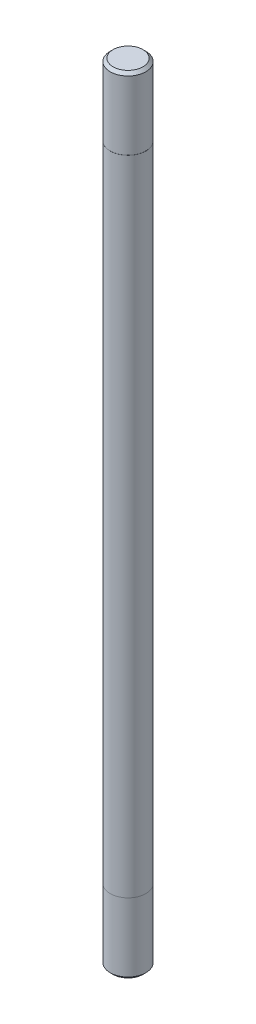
from build123d import *

# Parameters (mm, degrees)
SKETCH1_R      = 2.5
EXTRUDE1_DEPTH = 90
SKETCH2_R      = 2.49
EXTRUDE2_DEPTH = 10
EXTRUDE3_START = 10
SKETCH3_R      = 2.49
EXTRUDE3_DEPTH = 10
CHAMFER2_SIZE  = 0.4


with BuildPart() as part:
    # Sketch1 → Extrude1 (new body)
    with BuildSketch(Plane(origin=(0, 0, 0), x_dir=(1, 0, 0), z_dir=(0, 1, 0))):
        with Locations(Location((0, 0, 0), (0, 0, 90))):
            Circle(SKETCH1_R)
    extrude(amount=EXTRUDE1_DEPTH)

    # Sketch2 → Extrude2 (add)
    with BuildSketch(Plane(origin=(0, 90, 0), x_dir=(-1, 0, 0), z_dir=(0, 1, 0))):
        with Locations(Location((0, 0, 0), (0, 0, 90))):
            Circle(SKETCH2_R)
    extrude(amount=EXTRUDE2_DEPTH)

    # Sketch3 → Extrude3 (add)
    with BuildSketch(Plane.XZ.offset(EXTRUDE3_START)):
        with Locations(Location((0, 0, 0), (0, 0, 90))):
            Circle(SKETCH3_R)
    extrude(amount=-EXTRUDE3_DEPTH)

    # Chamfer2
    chamfer2_edges = [part.edges().sort_by_distance(p)[0] for p in [
        (0, -10, -2.49),
        (0, 100, -2.49),
    ]]
    chamfer(chamfer2_edges, length=CHAMFER2_SIZE)


solid = part.part
